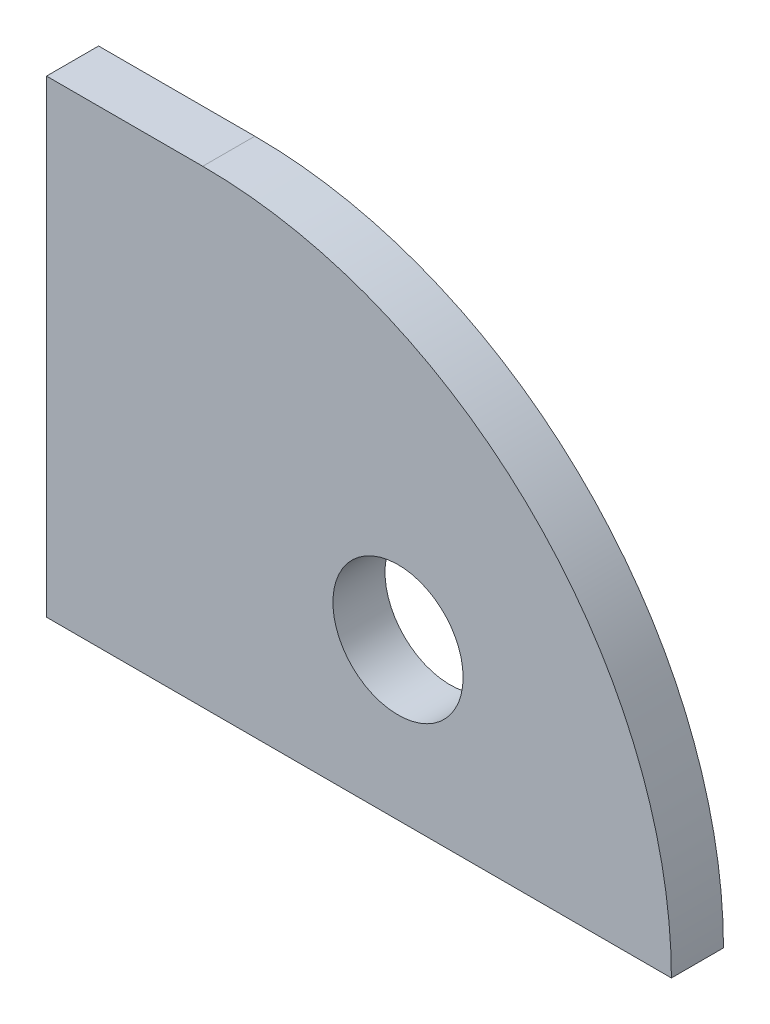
from build123d import *

# Parameters (mm, degrees)
BASE_EXTRUSION_DEPTH    = 2
ESQUISSE2_R             = 2.5
ENL_V_MAT_EXTRU_1_DEPTH = 2


with BuildPart() as part:
    # Esquisse1 → Base-Extrusion (new body)
    with BuildSketch(Plane.XY):
        with BuildLine():
            Line((27, 16.823481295), (27, -1.176518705))
            Line((27, -1.176518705), (51, -1.176518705))
            ThreePointArc((51, -1.176518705), (45.727922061, 11.551403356), (33, 16.823481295))
            Line((33, 16.823481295), (27, 16.823481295))
        make_face()
    extrude(amount=BASE_EXTRUSION_DEPTH)

    # Esquisse2 → Enl_v. mat.-Extru.1 (cut)
    with BuildSketch(Plane.XY.offset(2)):
        with Locations((40.5, 4.823481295)):
            Circle(ESQUISSE2_R)
    extrude(amount=-ENL_V_MAT_EXTRU_1_DEPTH, mode=Mode.SUBTRACT)


solid = part.part
